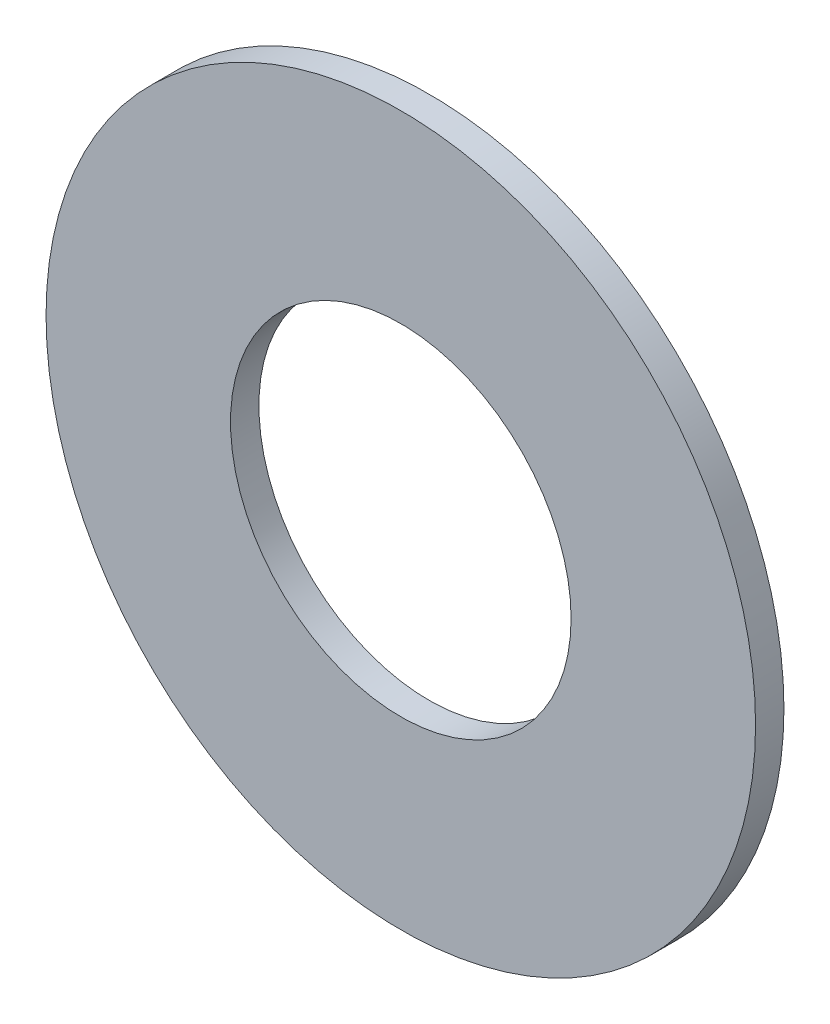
ISO-10303-21;
HEADER;
FILE_DESCRIPTION(('STEP AP214'),'2;1');
FILE_NAME('part.step','',(''),(''),'','','');
FILE_SCHEMA(('AUTOMOTIVE_DESIGN { 1 0 10303 214 1 1 1 1 }'));
ENDSEC;
DATA;
#1=APPLICATION_CONTEXT('core data for automotive mechanical design processes');
#2=APPLICATION_PROTOCOL_DEFINITION('international standard','automotive_design',2000,#1);
#3=PRODUCT_CONTEXT('',#1,'mechanical');
#4=PRODUCT('Part','Part','',(#3));
#5=PRODUCT_RELATED_PRODUCT_CATEGORY('part','',(#4));
#6=PRODUCT_DEFINITION_FORMATION('','',#4);
#7=PRODUCT_DEFINITION_CONTEXT('part definition',#1,'design');
#8=PRODUCT_DEFINITION('design','',#6,#7);
#9=PRODUCT_DEFINITION_SHAPE('','',#8);
#10=(LENGTH_UNIT() NAMED_UNIT(*) SI_UNIT(.MILLI.,.METRE.));
#11=(NAMED_UNIT(*) PLANE_ANGLE_UNIT() SI_UNIT($,.RADIAN.));
#12=(NAMED_UNIT(*) SI_UNIT($,.STERADIAN.) SOLID_ANGLE_UNIT());
#13=UNCERTAINTY_MEASURE_WITH_UNIT(LENGTH_MEASURE(1.E-05),#10,'distance_accuracy_value','');
#14=(GEOMETRIC_REPRESENTATION_CONTEXT(3) GLOBAL_UNCERTAINTY_ASSIGNED_CONTEXT((#13)) GLOBAL_UNIT_ASSIGNED_CONTEXT((#10,
#11,#12)) REPRESENTATION_CONTEXT('',''));
#15=CARTESIAN_POINT('',(0.,0.,0.));
#16=DIRECTION('',(0.,0.,1.));
#17=DIRECTION('',(1.,0.,0.));
#18=AXIS2_PLACEMENT_3D('',#15,#16,#17);
#19=CARTESIAN_POINT('',(0.,0.,10.));
#20=DIRECTION('',(0.,0.,1.));
#21=DIRECTION('',(1.,0.,0.));
#22=AXIS2_PLACEMENT_3D('',#19,#20,#21);
#23=PLANE('',#22);
#24=CARTESIAN_POINT('',(0.,0.,10.));
#25=DIRECTION('',(0.,0.,1.));
#26=DIRECTION('',(1.,0.,0.));
#27=AXIS2_PLACEMENT_3D('',#24,#25,#26);
#28=CIRCLE('',#27,125.);
#29=CARTESIAN_POINT('',(125.,0.,10.));
#30=VERTEX_POINT('',#29);
#31=EDGE_CURVE('E10',#30,#30,#28,.T.);
#32=ORIENTED_EDGE('',*,*,#31,.T.);
#33=EDGE_LOOP('',(#32));
#34=FACE_BOUND('',#33,.T.);
#35=CARTESIAN_POINT('',(0.,0.,10.));
#36=DIRECTION('',(0.,0.,1.));
#37=DIRECTION('',(1.,0.,0.));
#38=AXIS2_PLACEMENT_3D('',#35,#36,#37);
#39=CIRCLE('',#38,60.);
#40=CARTESIAN_POINT('',(60.,0.,10.));
#41=VERTEX_POINT('',#40);
#42=EDGE_CURVE('E41',#41,#41,#39,.T.);
#43=ORIENTED_EDGE('',*,*,#42,.F.);
#44=EDGE_LOOP('',(#43));
#45=FACE_BOUND('',#44,.T.);
#46=ADVANCED_FACE('F30',(#34,#45),#23,.T.);
#47=CARTESIAN_POINT('',(0.,0.,0.));
#48=DIRECTION('',(0.,0.,1.));
#49=DIRECTION('',(1.,0.,0.));
#50=AXIS2_PLACEMENT_3D('',#47,#48,#49);
#51=PLANE('',#50);
#52=CARTESIAN_POINT('',(0.,0.,0.));
#53=DIRECTION('',(0.,0.,1.));
#54=DIRECTION('',(1.,0.,0.));
#55=AXIS2_PLACEMENT_3D('',#52,#53,#54);
#56=CIRCLE('',#55,125.);
#57=CARTESIAN_POINT('',(125.,0.,0.));
#58=VERTEX_POINT('',#57);
#59=EDGE_CURVE('E37',#58,#58,#56,.T.);
#60=ORIENTED_EDGE('',*,*,#59,.F.);
#61=EDGE_LOOP('',(#60));
#62=FACE_BOUND('',#61,.T.);
#63=CARTESIAN_POINT('',(0.,0.,0.));
#64=DIRECTION('',(0.,0.,1.));
#65=DIRECTION('',(1.,0.,0.));
#66=AXIS2_PLACEMENT_3D('',#63,#64,#65);
#67=CIRCLE('',#66,60.);
#68=CARTESIAN_POINT('',(60.,0.,0.));
#69=VERTEX_POINT('',#68);
#70=EDGE_CURVE('E45',#69,#69,#67,.T.);
#71=ORIENTED_EDGE('',*,*,#70,.T.);
#72=EDGE_LOOP('',(#71));
#73=FACE_BOUND('',#72,.T.);
#74=ADVANCED_FACE('F51',(#62,#73),#51,.F.);
#75=CARTESIAN_POINT('',(0.,0.,10.));
#76=DIRECTION('',(0.,0.,-1.));
#77=DIRECTION('',(-1.,0.,0.));
#78=AXIS2_PLACEMENT_3D('',#75,#76,#77);
#79=CYLINDRICAL_SURFACE('',#78,125.);
#80=ORIENTED_EDGE('',*,*,#31,.F.);
#81=EDGE_LOOP('',(#80));
#82=FACE_BOUND('',#81,.T.);
#83=ORIENTED_EDGE('',*,*,#59,.T.);
#84=EDGE_LOOP('',(#83));
#85=FACE_BOUND('',#84,.T.);
#86=ADVANCED_FACE('F32',(#82,#85),#79,.T.);
#87=CARTESIAN_POINT('',(0.,0.,10.));
#88=DIRECTION('',(0.,0.,-1.));
#89=DIRECTION('',(-1.,0.,0.));
#90=AXIS2_PLACEMENT_3D('',#87,#88,#89);
#91=CYLINDRICAL_SURFACE('',#90,60.);
#92=ORIENTED_EDGE('',*,*,#42,.T.);
#93=EDGE_LOOP('',(#92));
#94=FACE_BOUND('',#93,.T.);
#95=ORIENTED_EDGE('',*,*,#70,.F.);
#96=EDGE_LOOP('',(#95));
#97=FACE_BOUND('',#96,.T.);
#98=ADVANCED_FACE('F53',(#94,#97),#91,.F.);
#99=CLOSED_SHELL('',(#46,#74,#86,#98));
#100=MANIFOLD_SOLID_BREP('B2',#99);
#101=ADVANCED_BREP_SHAPE_REPRESENTATION('',(#18,#100),#14);
#102=SHAPE_DEFINITION_REPRESENTATION(#9,#101);
ENDSEC;
END-ISO-10303-21;
